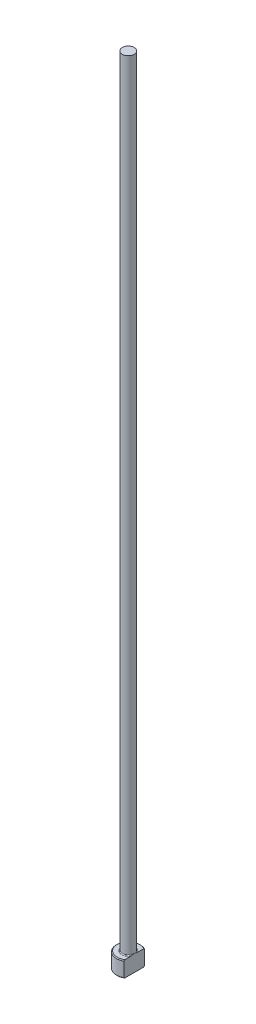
ISO-10303-21;
HEADER;
FILE_DESCRIPTION(('STEP AP214'),'2;1');
FILE_NAME('part.step','',(''),(''),'','','');
FILE_SCHEMA(('AUTOMOTIVE_DESIGN { 1 0 10303 214 1 1 1 1 }'));
ENDSEC;
DATA;
#1=APPLICATION_CONTEXT('core data for automotive mechanical design processes');
#2=APPLICATION_PROTOCOL_DEFINITION('international standard','automotive_design',2000,#1);
#3=PRODUCT_CONTEXT('',#1,'mechanical');
#4=PRODUCT('Part','Part','',(#3));
#5=PRODUCT_RELATED_PRODUCT_CATEGORY('part','',(#4));
#6=PRODUCT_DEFINITION_FORMATION('','',#4);
#7=PRODUCT_DEFINITION_CONTEXT('part definition',#1,'design');
#8=PRODUCT_DEFINITION('design','',#6,#7);
#9=PRODUCT_DEFINITION_SHAPE('','',#8);
#10=(LENGTH_UNIT() NAMED_UNIT(*) SI_UNIT(.MILLI.,.METRE.));
#11=(NAMED_UNIT(*) PLANE_ANGLE_UNIT() SI_UNIT($,.RADIAN.));
#12=(NAMED_UNIT(*) SI_UNIT($,.STERADIAN.) SOLID_ANGLE_UNIT());
#13=UNCERTAINTY_MEASURE_WITH_UNIT(LENGTH_MEASURE(1.E-05),#10,'distance_accuracy_value','');
#14=(GEOMETRIC_REPRESENTATION_CONTEXT(3) GLOBAL_UNCERTAINTY_ASSIGNED_CONTEXT((#13)) GLOBAL_UNIT_ASSIGNED_CONTEXT((#10,
#11,#12)) REPRESENTATION_CONTEXT('',''));
#15=CARTESIAN_POINT('',(0.,0.,0.));
#16=DIRECTION('',(0.,0.,1.));
#17=DIRECTION('',(1.,0.,0.));
#18=AXIS2_PLACEMENT_3D('',#15,#16,#17);
#19=CARTESIAN_POINT('',(0.,0.,0.));
#20=DIRECTION('',(0.,-1.,0.));
#21=DIRECTION('',(0.,0.,-1.));
#22=AXIS2_PLACEMENT_3D('',#19,#20,#21);
#23=PLANE('',#22);
#24=CARTESIAN_POINT('',(0.,0.,0.));
#25=DIRECTION('',(0.,-1.,0.));
#26=DIRECTION('',(0.,0.,-1.));
#27=AXIS2_PLACEMENT_3D('',#24,#25,#26);
#28=CIRCLE('',#27,2.79999999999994);
#29=CARTESIAN_POINT('',(1.49999999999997,0.,2.36431808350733));
#30=VERTEX_POINT('',#29);
#31=CARTESIAN_POINT('',(1.49999999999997,0.,-2.36431808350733));
#32=VERTEX_POINT('',#31);
#33=EDGE_CURVE('E98',#30,#32,#28,.T.);
#34=ORIENTED_EDGE('',*,*,#33,.T.);
#35=DIRECTION('',(0.,0.,1.));
#36=VECTOR('',#35,1.);
#37=CARTESIAN_POINT('',(1.49999999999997,0.,2.5980762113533));
#38=LINE('',#37,#36);
#39=EDGE_CURVE('E83',#32,#30,#38,.T.);
#40=ORIENTED_EDGE('',*,*,#39,.T.);
#41=EDGE_LOOP('',(#34,#40));
#42=FACE_BOUND('',#41,.T.);
#43=ADVANCED_FACE('F32',(#42),#23,.T.);
#44=CARTESIAN_POINT('',(0.,259.958771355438,0.));
#45=DIRECTION('',(0.,1.,0.));
#46=DIRECTION('',(0.,0.,1.));
#47=AXIS2_PLACEMENT_3D('',#44,#45,#46);
#48=CYLINDRICAL_SURFACE('',#47,2.99999999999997);
#49=CARTESIAN_POINT('',(0.,3.79999999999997,0.));
#50=DIRECTION('',(0.,1.,0.));
#51=DIRECTION('',(0.,0.,1.));
#52=AXIS2_PLACEMENT_3D('',#49,#50,#51);
#53=CIRCLE('',#52,2.99999999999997);
#54=CARTESIAN_POINT('',(1.49999999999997,3.79999999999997,2.5980762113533));
#55=VERTEX_POINT('',#54);
#56=CARTESIAN_POINT('',(1.49999999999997,3.79999999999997,-2.5980762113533));
#57=VERTEX_POINT('',#56);
#58=EDGE_CURVE('E104',#55,#57,#53,.F.);
#59=ORIENTED_EDGE('',*,*,#58,.T.);
#60=DIRECTION('',(0.,-1.,0.));
#61=VECTOR('',#60,1.);
#62=CARTESIAN_POINT('',(1.49999999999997,200.,-2.5980762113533));
#63=LINE('',#62,#61);
#64=CARTESIAN_POINT('',(1.49999999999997,0.200000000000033,-2.5980762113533));
#65=VERTEX_POINT('',#64);
#66=EDGE_CURVE('E183',#57,#65,#63,.T.);
#67=ORIENTED_EDGE('',*,*,#66,.T.);
#68=CARTESIAN_POINT('',(0.,0.200000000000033,0.));
#69=DIRECTION('',(0.,-1.,0.));
#70=DIRECTION('',(0.,0.,-1.));
#71=AXIS2_PLACEMENT_3D('',#68,#69,#70);
#72=CIRCLE('',#71,2.99999999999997);
#73=CARTESIAN_POINT('',(1.49999999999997,0.200000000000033,2.5980762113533));
#74=VERTEX_POINT('',#73);
#75=EDGE_CURVE('E100',#65,#74,#72,.F.);
#76=ORIENTED_EDGE('',*,*,#75,.T.);
#77=DIRECTION('',(0.,-1.,0.));
#78=VECTOR('',#77,1.);
#79=CARTESIAN_POINT('',(1.49999999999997,200.,2.5980762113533));
#80=LINE('',#79,#78);
#81=EDGE_CURVE('E93',#55,#74,#80,.T.);
#82=ORIENTED_EDGE('',*,*,#81,.F.);
#83=EDGE_LOOP('',(#59,#67,#76,#82));
#84=FACE_BOUND('',#83,.T.);
#85=ADVANCED_FACE('F158',(#84),#48,.T.);
#86=CARTESIAN_POINT('',(-2.99999999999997,4.,0.));
#87=DIRECTION('',(0.,1.,0.));
#88=DIRECTION('',(0.,0.,1.));
#89=AXIS2_PLACEMENT_3D('',#86,#87,#88);
#90=PLANE('',#89);
#91=CARTESIAN_POINT('',(0.,4.,0.));
#92=DIRECTION('',(0.,1.,0.));
#93=DIRECTION('',(0.,0.,1.));
#94=AXIS2_PLACEMENT_3D('',#91,#92,#93);
#95=CIRCLE('',#94,2.79999999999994);
#96=CARTESIAN_POINT('',(1.49999999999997,4.,-2.36431808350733));
#97=VERTEX_POINT('',#96);
#98=CARTESIAN_POINT('',(1.49999999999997,4.,2.36431808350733));
#99=VERTEX_POINT('',#98);
#100=EDGE_CURVE('E178',#97,#99,#95,.T.);
#101=ORIENTED_EDGE('',*,*,#100,.T.);
#102=DIRECTION('',(0.,0.,-1.));
#103=VECTOR('',#102,1.);
#104=CARTESIAN_POINT('',(1.49999999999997,4.,0.));
#105=LINE('',#104,#103);
#106=CARTESIAN_POINT('',(1.49999999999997,3.99999999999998,0.799999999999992));
#107=VERTEX_POINT('',#106);
#108=EDGE_CURVE('E57',#99,#107,#105,.T.);
#109=ORIENTED_EDGE('',*,*,#108,.T.);
#110=CARTESIAN_POINT('',(0.,4.,0.));
#111=DIRECTION('',(0.,1.,0.));
#112=DIRECTION('',(0.,0.,1.));
#113=AXIS2_PLACEMENT_3D('',#110,#111,#112);
#114=CIRCLE('',#113,1.69999999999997);
#115=CARTESIAN_POINT('',(1.49999999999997,3.99999999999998,-0.799999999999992));
#116=VERTEX_POINT('',#115);
#117=EDGE_CURVE('E107',#107,#116,#114,.F.);
#118=ORIENTED_EDGE('',*,*,#117,.T.);
#119=EDGE_CURVE('E136',#116,#97,#105,.T.);
#120=ORIENTED_EDGE('',*,*,#119,.T.);
#121=EDGE_LOOP('',(#101,#109,#118,#120));
#122=FACE_BOUND('',#121,.T.);
#123=ADVANCED_FACE('F147',(#122),#90,.T.);
#124=CARTESIAN_POINT('',(0.,4.,0.));
#125=DIRECTION('',(0.,-1.,0.));
#126=DIRECTION('',(0.,0.,-1.));
#127=AXIS2_PLACEMENT_3D('',#124,#125,#126);
#128=CONICAL_SURFACE('',#127,2.79999999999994,0.785398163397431);
#129=ORIENTED_EDGE('',*,*,#58,.F.);
#130=CARTESIAN_POINT('',(1.49999999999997,0.888258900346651,5.71827621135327));
#131=CARTESIAN_POINT('',(1.49999999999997,1.01361833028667,5.58866816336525));
#132=CARTESIAN_POINT('',(1.49999999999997,1.13884324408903,5.45892957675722));
#133=CARTESIAN_POINT('',(1.49999999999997,1.38894444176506,5.19911365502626));
#134=CARTESIAN_POINT('',(1.49999999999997,1.51382072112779,5.06903631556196));
#135=CARTESIAN_POINT('',(1.49999999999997,1.76320568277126,4.80840180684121));
#136=CARTESIAN_POINT('',(1.49999999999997,1.88771414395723,4.67784442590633));
#137=CARTESIAN_POINT('',(1.49999999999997,2.13618059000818,4.4162081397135));
#138=CARTESIAN_POINT('',(1.49999999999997,2.26013857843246,4.28512923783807));
#139=CARTESIAN_POINT('',(1.49999999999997,2.50488975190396,4.02490837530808));
#140=CARTESIAN_POINT('',(1.49999999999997,2.62569693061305,3.8957795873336));
#141=CARTESIAN_POINT('',(1.49999999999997,2.86640694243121,3.63668213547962));
#142=CARTESIAN_POINT('',(1.49999999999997,2.98630978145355,3.50671347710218));
#143=CARTESIAN_POINT('',(1.49999999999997,3.22486033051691,3.24567921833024));
#144=CARTESIAN_POINT('',(1.49999999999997,3.3435083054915,3.11461386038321));
#145=CARTESIAN_POINT('',(1.49999999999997,3.5790771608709,2.85094268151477));
#146=CARTESIAN_POINT('',(1.49999999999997,3.69599811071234,2.71833692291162));
#147=CARTESIAN_POINT('',(1.49999999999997,3.88262371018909,2.50255231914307));
#148=CARTESIAN_POINT('',(1.49999999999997,3.95312454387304,2.42006293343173));
#149=CARTESIAN_POINT('',(1.49999999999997,4.09287098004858,2.254010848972));
#150=CARTESIAN_POINT('',(1.49999999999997,4.16211645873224,2.17044804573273));
#151=CARTESIAN_POINT('',(1.49999999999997,4.29964684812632,2.00105967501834));
#152=CARTESIAN_POINT('',(1.49999999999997,4.36791386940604,1.9152195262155));
#153=CARTESIAN_POINT('',(1.49999999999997,4.50205840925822,1.7417139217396));
#154=CARTESIAN_POINT('',(1.49999999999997,4.56793649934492,1.65404891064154));
#155=CARTESIAN_POINT('',(1.49999999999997,4.69728151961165,1.47490236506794));
#156=CARTESIAN_POINT('',(1.49999999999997,4.76069661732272,1.38338308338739));
#157=CARTESIAN_POINT('',(1.49999999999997,4.88239539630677,1.19675661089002));
#158=CARTESIAN_POINT('',(1.49999999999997,4.94067201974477,1.10164473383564));
#159=CARTESIAN_POINT('',(1.49999999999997,5.048413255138,0.908008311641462));
#160=CARTESIAN_POINT('',(1.49999999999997,5.09797809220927,0.809540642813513));
#161=CARTESIAN_POINT('',(1.49999999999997,5.18432188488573,0.607192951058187));
#162=CARTESIAN_POINT('',(1.49999999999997,5.22114374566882,0.503332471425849));
#163=CARTESIAN_POINT('',(1.49999999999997,5.26099935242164,0.347577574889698));
#164=CARTESIAN_POINT('',(1.49999999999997,5.2715702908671,0.297609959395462));
#165=CARTESIAN_POINT('',(1.49999999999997,5.28794860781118,0.196885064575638));
#166=CARTESIAN_POINT('',(1.49999999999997,5.29375640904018,0.146127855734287));
#167=CARTESIAN_POINT('',(1.49999999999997,5.30019707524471,0.0444388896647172));
#168=CARTESIAN_POINT('',(1.49999999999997,5.30084594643,-0.00649183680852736));
#169=CARTESIAN_POINT('',(1.49999999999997,5.29696416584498,-0.108155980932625));
#170=CARTESIAN_POINT('',(1.49999999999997,5.29243308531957,-0.158889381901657));
#171=CARTESIAN_POINT('',(1.49999999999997,5.27856915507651,-0.259234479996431));
#172=CARTESIAN_POINT('',(1.49999999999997,5.2692782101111,-0.308852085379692));
#173=CARTESIAN_POINT('',(1.49999999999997,5.24647108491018,-0.407110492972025));
#174=CARTESIAN_POINT('',(1.49999999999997,5.23295324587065,-0.455750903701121));
#175=CARTESIAN_POINT('',(1.49999999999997,5.20226175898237,-0.55214996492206));
#176=CARTESIAN_POINT('',(1.49999999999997,5.18506801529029,-0.599902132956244));
#177=CARTESIAN_POINT('',(1.49999999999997,5.1477138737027,-0.694205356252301));
#178=CARTESIAN_POINT('',(1.49999999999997,5.12755408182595,-0.740756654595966));
#179=CARTESIAN_POINT('',(1.49999999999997,5.0632769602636,-0.879166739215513));
#180=CARTESIAN_POINT('',(1.49999999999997,5.01551721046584,-0.969329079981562));
#181=CARTESIAN_POINT('',(1.49999999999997,4.91367909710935,-1.14604316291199));
#182=CARTESIAN_POINT('',(1.49999999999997,4.85959300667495,-1.2325903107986));
#183=CARTESIAN_POINT('',(1.49999999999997,4.74697968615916,-1.40321348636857));
#184=CARTESIAN_POINT('',(1.49999999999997,4.68843573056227,-1.4872783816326));
#185=CARTESIAN_POINT('',(1.49999999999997,4.5684384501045,-1.65322187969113));
#186=CARTESIAN_POINT('',(1.49999999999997,4.50698656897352,-1.73510153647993));
#187=CARTESIAN_POINT('',(1.49999999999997,4.3811567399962,-1.89829823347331));
#188=CARTESIAN_POINT('',(1.49999999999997,4.31675092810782,-1.97959369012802));
#189=CARTESIAN_POINT('',(1.49999999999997,4.18634068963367,-2.14090082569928));
#190=CARTESIAN_POINT('',(1.49999999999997,4.12033609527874,-2.2209123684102));
#191=CARTESIAN_POINT('',(1.49999999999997,3.92086431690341,-2.45906508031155));
#192=CARTESIAN_POINT('',(1.49999999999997,3.78562663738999,-2.6157209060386));
#193=CARTESIAN_POINT('',(1.49999999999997,3.53554498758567,-2.90006295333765));
#194=CARTESIAN_POINT('',(1.49999999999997,3.42114543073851,-3.02814382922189));
#195=CARTESIAN_POINT('',(1.49999999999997,3.19093557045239,-3.28303767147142));
#196=CARTESIAN_POINT('',(1.49999999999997,3.07512522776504,-3.40985060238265));
#197=CARTESIAN_POINT('',(1.49999999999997,2.72597067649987,-3.78913849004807));
#198=CARTESIAN_POINT('',(1.49999999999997,2.49111760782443,-4.04022177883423));
#199=CARTESIAN_POINT('',(1.49999999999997,2.0288247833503,-4.52992803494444));
#200=CARTESIAN_POINT('',(1.49999999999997,1.80147747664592,-4.76863870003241));
#201=CARTESIAN_POINT('',(1.49999999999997,1.45954865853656,-5.12558036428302));
#202=CARTESIAN_POINT('',(1.49999999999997,1.34548484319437,-5.24430773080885));
#203=CARTESIAN_POINT('',(1.49999999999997,1.11707176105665,-5.48148573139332));
#204=CARTESIAN_POINT('',(1.49999999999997,1.00272249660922,-5.59993636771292));
#205=CARTESIAN_POINT('',(1.49999999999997,0.888258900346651,-5.71827621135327));
#206=B_SPLINE_CURVE_WITH_KNOTS('',3,(#130,#131,#132,#133,#134,#135,#136,#137,#138,#139,#140,
#141,#142,#143,#144,#145,#146,#147,#148,#149,#150,#151,#152,#153,#154,#155,#156,#157,#158,#159,
#160,#161,#162,#163,#164,#165,#166,#167,#168,#169,#170,#171,#172,#173,#174,#175,#176,#177,#178,
#179,#180,#181,#182,#183,#184,#185,#186,#187,#188,#189,#190,#191,#192,#193,#194,#195,#196,#197,
#198,#199,#200,#201,#202,#203,#204,#205),.UNSPECIFIED.,.F.,.F.,(4,2,2,2,2,2,2,2,2,2,2,2,2,2,2,2,
2,2,2,2,2,2,2,2,2,2,2,2,2,2,2,2,2,2,2,2,2,4),(0.,0.540943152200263,1.08189327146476,
1.62312052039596,2.16434426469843,2.69482920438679,3.22531067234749,3.75567781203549,
4.28602356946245,4.611550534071,4.9371094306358,5.26610945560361,5.59503024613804,
5.92894782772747,6.26331713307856,6.59354403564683,6.92264800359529,7.07567478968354,
7.22868799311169,7.38122626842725,7.53377717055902,7.6850075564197,7.83629736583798,
7.988436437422,8.14054446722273,8.44618799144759,8.75220879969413,9.05944044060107,
9.3665211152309,9.67764287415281,9.98879742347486,10.609592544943,11.1247803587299,
11.6399825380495,12.6713544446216,13.6603005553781,14.1542238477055,14.6481430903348),.UNSPECIFIED.);
#207=EDGE_CURVE('E135',#55,#99,#206,.T.);
#208=ORIENTED_EDGE('',*,*,#207,.T.);
#209=ORIENTED_EDGE('',*,*,#100,.F.);
#210=EDGE_CURVE('E127',#97,#57,#206,.T.);
#211=ORIENTED_EDGE('',*,*,#210,.T.);
#212=EDGE_LOOP('',(#129,#208,#209,#211));
#213=FACE_BOUND('',#212,.T.);
#214=ADVANCED_FACE('F143',(#213),#128,.T.);
#215=CARTESIAN_POINT('',(0.,0.200000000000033,0.));
#216=DIRECTION('',(0.,1.,0.));
#217=DIRECTION('',(0.,0.,1.));
#218=AXIS2_PLACEMENT_3D('',#215,#216,#217);
#219=CONICAL_SURFACE('',#218,2.99999999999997,0.785398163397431);
#220=ORIENTED_EDGE('',*,*,#75,.F.);
#221=CARTESIAN_POINT('',(1.49999999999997,3.11174109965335,-5.71827621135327));
#222=CARTESIAN_POINT('',(1.49999999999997,2.98638166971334,-5.58866816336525));
#223=CARTESIAN_POINT('',(1.49999999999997,2.86115675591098,-5.45892957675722));
#224=CARTESIAN_POINT('',(1.49999999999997,2.61105555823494,-5.19911365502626));
#225=CARTESIAN_POINT('',(1.49999999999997,2.48617927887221,-5.06903631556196));
#226=CARTESIAN_POINT('',(1.49999999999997,2.23679431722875,-4.80840180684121));
#227=CARTESIAN_POINT('',(1.49999999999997,2.11228585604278,-4.67784442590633));
#228=CARTESIAN_POINT('',(1.49999999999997,1.86381940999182,-4.4162081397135));
#229=CARTESIAN_POINT('',(1.49999999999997,1.73986142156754,-4.28512923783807));
#230=CARTESIAN_POINT('',(1.49999999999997,1.49511024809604,-4.02490837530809));
#231=CARTESIAN_POINT('',(1.49999999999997,1.37430306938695,-3.8957795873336));
#232=CARTESIAN_POINT('',(1.49999999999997,1.13359305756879,-3.63668213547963));
#233=CARTESIAN_POINT('',(1.49999999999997,1.01369021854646,-3.50671347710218));
#234=CARTESIAN_POINT('',(1.49999999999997,0.775139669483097,-3.24567921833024));
#235=CARTESIAN_POINT('',(1.49999999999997,0.656491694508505,-3.11461386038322));
#236=CARTESIAN_POINT('',(1.49999999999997,0.420922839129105,-2.85094268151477));
#237=CARTESIAN_POINT('',(1.49999999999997,0.304001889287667,-2.71833692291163));
#238=CARTESIAN_POINT('',(1.49999999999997,0.117376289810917,-2.50255231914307));
#239=CARTESIAN_POINT('',(1.49999999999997,0.0468754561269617,-2.42006293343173));
#240=CARTESIAN_POINT('',(1.49999999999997,-0.0928709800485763,-2.254010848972));
#241=CARTESIAN_POINT('',(1.49999999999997,-0.162116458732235,-2.17044804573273));
#242=CARTESIAN_POINT('',(1.49999999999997,-0.299646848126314,-2.00105967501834));
#243=CARTESIAN_POINT('',(1.49999999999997,-0.367913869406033,-1.9152195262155));
#244=CARTESIAN_POINT('',(1.49999999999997,-0.502058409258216,-1.7417139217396));
#245=CARTESIAN_POINT('',(1.49999999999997,-0.567936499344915,-1.65404891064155));
#246=CARTESIAN_POINT('',(1.49999999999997,-0.69728151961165,-1.47490236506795));
#247=CARTESIAN_POINT('',(1.49999999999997,-0.760696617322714,-1.38338308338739));
#248=CARTESIAN_POINT('',(1.49999999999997,-0.882395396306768,-1.19675661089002));
#249=CARTESIAN_POINT('',(1.49999999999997,-0.940672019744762,-1.10164473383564));
#250=CARTESIAN_POINT('',(1.49999999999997,-1.04841325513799,-0.908008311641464));
#251=CARTESIAN_POINT('',(1.49999999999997,-1.09797809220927,-0.809540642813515));
#252=CARTESIAN_POINT('',(1.49999999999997,-1.18432188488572,-0.607192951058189));
#253=CARTESIAN_POINT('',(1.49999999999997,-1.22114374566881,-0.503332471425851));
#254=CARTESIAN_POINT('',(1.49999999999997,-1.26099935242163,-0.347577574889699));
#255=CARTESIAN_POINT('',(1.49999999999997,-1.2715702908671,-0.297609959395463));
#256=CARTESIAN_POINT('',(1.49999999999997,-1.28794860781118,-0.196885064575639));
#257=CARTESIAN_POINT('',(1.49999999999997,-1.29375640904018,-0.146127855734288));
#258=CARTESIAN_POINT('',(1.49999999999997,-1.30019707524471,-0.0444388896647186));
#259=CARTESIAN_POINT('',(1.49999999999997,-1.30084594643,0.00649183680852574));
#260=CARTESIAN_POINT('',(1.49999999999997,-1.29696416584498,0.108155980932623));
#261=CARTESIAN_POINT('',(1.49999999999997,-1.29243308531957,0.158889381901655));
#262=CARTESIAN_POINT('',(1.49999999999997,-1.2785691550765,0.259234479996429));
#263=CARTESIAN_POINT('',(1.49999999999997,-1.2692782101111,0.30885208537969));
#264=CARTESIAN_POINT('',(1.49999999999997,-1.24647108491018,0.407110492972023));
#265=CARTESIAN_POINT('',(1.49999999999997,-1.23295324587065,0.45575090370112));
#266=CARTESIAN_POINT('',(1.49999999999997,-1.20226175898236,0.552149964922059));
#267=CARTESIAN_POINT('',(1.49999999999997,-1.18506801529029,0.599902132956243));
#268=CARTESIAN_POINT('',(1.49999999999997,-1.14771387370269,0.6942053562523));
#269=CARTESIAN_POINT('',(1.49999999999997,-1.12755408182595,0.740756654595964));
#270=CARTESIAN_POINT('',(1.49999999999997,-1.0632769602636,0.879166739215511));
#271=CARTESIAN_POINT('',(1.49999999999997,-1.01551721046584,0.969329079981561));
#272=CARTESIAN_POINT('',(1.49999999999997,-0.913679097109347,1.14604316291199));
#273=CARTESIAN_POINT('',(1.49999999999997,-0.85959300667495,1.2325903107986));
#274=CARTESIAN_POINT('',(1.49999999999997,-0.746979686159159,1.40321348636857));
#275=CARTESIAN_POINT('',(1.49999999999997,-0.688435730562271,1.4872783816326));
#276=CARTESIAN_POINT('',(1.49999999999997,-0.568438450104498,1.65322187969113));
#277=CARTESIAN_POINT('',(1.49999999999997,-0.506986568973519,1.73510153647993));
#278=CARTESIAN_POINT('',(1.49999999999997,-0.3811567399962,1.89829823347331));
#279=CARTESIAN_POINT('',(1.49999999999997,-0.316750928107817,1.97959369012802));
#280=CARTESIAN_POINT('',(1.49999999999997,-0.186340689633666,2.14090082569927));
#281=CARTESIAN_POINT('',(1.49999999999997,-0.120336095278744,2.22091236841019));
#282=CARTESIAN_POINT('',(1.49999999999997,0.0791356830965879,2.45906508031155));
#283=CARTESIAN_POINT('',(1.49999999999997,0.214373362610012,2.61572090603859));
#284=CARTESIAN_POINT('',(1.49999999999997,0.464455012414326,2.90006295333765));
#285=CARTESIAN_POINT('',(1.49999999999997,0.578854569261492,3.02814382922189));
#286=CARTESIAN_POINT('',(1.49999999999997,0.809064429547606,3.28303767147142));
#287=CARTESIAN_POINT('',(1.49999999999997,0.924874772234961,3.40985060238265));
#288=CARTESIAN_POINT('',(1.49999999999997,1.27402932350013,3.78913849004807));
#289=CARTESIAN_POINT('',(1.49999999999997,1.50888239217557,4.04022177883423));
#290=CARTESIAN_POINT('',(1.49999999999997,1.97117521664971,4.52992803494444));
#291=CARTESIAN_POINT('',(1.49999999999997,2.19852252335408,4.76863870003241));
#292=CARTESIAN_POINT('',(1.49999999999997,2.54045134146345,5.12558036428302));
#293=CARTESIAN_POINT('',(1.49999999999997,2.65451515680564,5.24430773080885));
#294=CARTESIAN_POINT('',(1.49999999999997,2.88292823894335,5.48148573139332));
#295=CARTESIAN_POINT('',(1.49999999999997,2.99727750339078,5.59993636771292));
#296=CARTESIAN_POINT('',(1.49999999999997,3.11174109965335,5.71827621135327));
#297=B_SPLINE_CURVE_WITH_KNOTS('',3,(#221,#222,#223,#224,#225,#226,#227,#228,#229,#230,#231,
#232,#233,#234,#235,#236,#237,#238,#239,#240,#241,#242,#243,#244,#245,#246,#247,#248,#249,#250,
#251,#252,#253,#254,#255,#256,#257,#258,#259,#260,#261,#262,#263,#264,#265,#266,#267,#268,#269,
#270,#271,#272,#273,#274,#275,#276,#277,#278,#279,#280,#281,#282,#283,#284,#285,#286,#287,#288,
#289,#290,#291,#292,#293,#294,#295,#296),.UNSPECIFIED.,.F.,.F.,(4,2,2,2,2,2,2,2,2,2,2,2,2,2,2,2,
2,2,2,2,2,2,2,2,2,2,2,2,2,2,2,2,2,2,2,2,2,4),(0.,0.540943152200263,1.08189327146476,
1.62312052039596,2.16434426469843,2.69482920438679,3.22531067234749,3.75567781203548,
4.28602356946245,4.611550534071,4.9371094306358,5.26610945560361,5.59503024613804,
5.92894782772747,6.26331713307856,6.59354403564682,6.92264800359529,7.07567478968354,
7.22868799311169,7.38122626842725,7.53377717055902,7.68500755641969,7.83629736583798,
7.988436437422,8.14054446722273,8.44618799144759,8.75220879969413,9.05944044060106,
9.3665211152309,9.6776428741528,9.98879742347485,10.609592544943,11.1247803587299,
11.6399825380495,12.6713544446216,13.6603005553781,14.1542238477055,14.6481430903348),.UNSPECIFIED.);
#298=EDGE_CURVE('E86',#65,#32,#297,.T.);
#299=ORIENTED_EDGE('',*,*,#298,.T.);
#300=ORIENTED_EDGE('',*,*,#33,.F.);
#301=EDGE_CURVE('E89',#30,#74,#297,.T.);
#302=ORIENTED_EDGE('',*,*,#301,.T.);
#303=EDGE_LOOP('',(#220,#299,#300,#302));
#304=FACE_BOUND('',#303,.T.);
#305=ADVANCED_FACE('F97',(#304),#219,.T.);
#306=CARTESIAN_POINT('',(0.,4.19999999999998,0.));
#307=DIRECTION('',(0.,1.,0.));
#308=DIRECTION('',(0.,0.,1.));
#309=AXIS2_PLACEMENT_3D('',#306,#307,#308);
#310=TOROIDAL_SURFACE('',#309,1.69999999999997,0.2);
#311=CARTESIAN_POINT('',(1.49999999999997,4.19999999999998,0.));
#312=CARTESIAN_POINT('',(1.49999999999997,4.20000050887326,7.14686072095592E-11));
#313=CARTESIAN_POINT('',(1.49999999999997,4.20000101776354,-1.21663673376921E-07));
#314=CARTESIAN_POINT('',(1.49999999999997,4.20000199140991,-4.97616237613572E-07));
#315=CARTESIAN_POINT('',(1.49999999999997,4.20000245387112,-7.5651622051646E-07));
#316=CARTESIAN_POINT('',(1.49999999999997,4.20000338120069,-1.37642837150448E-06));
#317=CARTESIAN_POINT('',(1.49999999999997,4.20000384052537,-1.74563476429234E-06));
#318=CARTESIAN_POINT('',(1.49999999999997,4.20000469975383,-2.53565984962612E-06));
#319=CARTESIAN_POINT('',(1.49999999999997,4.20000510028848,-2.95582597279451E-06));
#320=CARTESIAN_POINT('',(1.49999999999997,4.20000646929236,-4.48430445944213E-06));
#321=CARTESIAN_POINT('',(1.49999999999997,4.20000736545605,-5.65861039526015E-06));
#322=CARTESIAN_POINT('',(1.49999999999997,4.20000893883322,-8.06479202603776E-06));
#323=CARTESIAN_POINT('',(1.49999999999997,4.20000962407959,-9.29170517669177E-06));
#324=CARTESIAN_POINT('',(1.49999999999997,4.20001225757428,-1.416232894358E-05));
#325=CARTESIAN_POINT('',(1.49999999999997,4.20001407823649,-1.78790031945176E-05));
#326=CARTESIAN_POINT('',(1.49999999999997,4.20001699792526,-2.51443066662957E-05));
#327=CARTESIAN_POINT('',(1.49999999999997,4.20001815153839,-2.86715394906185E-05));
#328=CARTESIAN_POINT('',(1.49999999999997,4.20002315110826,-4.39218128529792E-05));
#329=CARTESIAN_POINT('',(1.49999999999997,4.20002701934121,-5.56288390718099E-05));
#330=CARTESIAN_POINT('',(1.49999999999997,4.20003312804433,-7.7405829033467E-05));
#331=CARTESIAN_POINT('',(1.49999999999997,4.20003553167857,-8.7427841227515E-05));
#332=CARTESIAN_POINT('',(1.49999999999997,4.20005483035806,-0.000161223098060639));
#333=CARTESIAN_POINT('',(1.49999999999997,4.20007979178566,-0.000222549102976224));
#334=CARTESIAN_POINT('',(1.49999999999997,4.20017391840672,-0.000462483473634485));
#335=CARTESIAN_POINT('',(1.49999999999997,4.20023706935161,-0.000642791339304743));
#336=CARTESIAN_POINT('',(1.49999999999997,4.20048761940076,-0.00134785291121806));
#337=CARTESIAN_POINT('',(1.49999999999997,4.20068132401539,-0.00187087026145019));
#338=CARTESIAN_POINT('',(1.49999999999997,4.20147357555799,-0.00402004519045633));
#339=CARTESIAN_POINT('',(1.49999999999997,4.20206499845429,-0.00564811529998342));
#340=CARTESIAN_POINT('',(1.49999999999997,4.20892634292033,-0.0245232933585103));
#341=CARTESIAN_POINT('',(1.49999999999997,4.21523683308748,-0.0417598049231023));
#342=CARTESIAN_POINT('',(1.49999999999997,4.22755028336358,-0.0756091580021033));
#343=CARTESIAN_POINT('',(1.49999999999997,4.23355589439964,-0.0922211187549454));
#344=CARTESIAN_POINT('',(1.49999999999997,4.24620101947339,-0.12745424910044));
#345=CARTESIAN_POINT('',(1.49999999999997,4.25283080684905,-0.146078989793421));
#346=CARTESIAN_POINT('',(1.49999999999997,4.26599765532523,-0.183577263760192));
#347=CARTESIAN_POINT('',(1.49999999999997,4.27253305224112,-0.202451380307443));
#348=CARTESIAN_POINT('',(1.49999999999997,4.28834228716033,-0.248982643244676));
#349=CARTESIAN_POINT('',(1.49999999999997,4.2974915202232,-0.276682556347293));
#350=CARTESIAN_POINT('',(1.49999999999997,4.31490935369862,-0.331625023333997));
#351=CARTESIAN_POINT('',(1.49999999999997,4.32319386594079,-0.35886250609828));
#352=CARTESIAN_POINT('',(1.49999999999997,4.34051594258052,-0.419125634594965));
#353=CARTESIAN_POINT('',(1.49999999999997,4.34936607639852,-0.452206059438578));
#354=CARTESIAN_POINT('',(1.49999999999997,4.36549583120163,-0.519023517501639));
#355=CARTESIAN_POINT('',(1.49999999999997,4.37276283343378,-0.55276364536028));
#356=CARTESIAN_POINT('',(1.49999999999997,4.38554755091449,-0.623053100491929));
#357=CARTESIAN_POINT('',(1.49999999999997,4.39090573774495,-0.659632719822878));
#358=CARTESIAN_POINT('',(1.49999999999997,4.39825016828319,-0.733028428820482));
#359=CARTESIAN_POINT('',(1.49999999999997,4.40024734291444,-0.769843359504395));
#360=CARTESIAN_POINT('',(1.49999999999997,4.39970780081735,-0.842856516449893));
#361=CARTESIAN_POINT('',(1.49999999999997,4.39725347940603,-0.87905368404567));
#362=CARTESIAN_POINT('',(1.49999999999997,4.38900085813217,-0.932380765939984));
#363=CARTESIAN_POINT('',(1.49999999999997,4.38553049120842,-0.949868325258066));
#364=CARTESIAN_POINT('',(1.49999999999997,4.37678336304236,-0.984374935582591));
#365=CARTESIAN_POINT('',(1.49999999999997,4.37150943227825,-1.00139467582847));
#366=CARTESIAN_POINT('',(1.49999999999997,4.35869781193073,-1.03479423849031));
#367=CARTESIAN_POINT('',(1.49999999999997,4.3511359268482,-1.05116499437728));
#368=CARTESIAN_POINT('',(1.49999999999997,4.33325333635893,-1.08234828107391));
#369=CARTESIAN_POINT('',(1.49999999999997,4.32294266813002,-1.097166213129));
#370=CARTESIAN_POINT('',(1.49999999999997,4.30512758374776,-1.11714173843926));
#371=CARTESIAN_POINT('',(1.49999999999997,4.29884721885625,-1.1233906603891));
#372=CARTESIAN_POINT('',(1.49999999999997,4.28545950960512,-1.13494695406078));
#373=CARTESIAN_POINT('',(1.49999999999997,4.27835226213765,-1.14025443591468));
#374=CARTESIAN_POINT('',(1.49999999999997,4.26325970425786,-1.14967631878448));
#375=CARTESIAN_POINT('',(1.49999999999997,4.25526534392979,-1.1537764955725));
#376=CARTESIAN_POINT('',(1.49999999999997,4.23863207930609,-1.16034952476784));
#377=CARTESIAN_POINT('',(1.49999999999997,4.22999427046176,-1.16282507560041));
#378=CARTESIAN_POINT('',(1.49999999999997,4.21343922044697,-1.16570267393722));
#379=CARTESIAN_POINT('',(1.49999999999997,4.20555896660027,-1.16631687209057));
#380=CARTESIAN_POINT('',(1.49999999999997,4.18982775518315,-1.16602054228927));
#381=CARTESIAN_POINT('',(1.49999999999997,4.18197679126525,-1.16511036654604));
#382=CARTESIAN_POINT('',(1.49999999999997,4.16747846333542,-1.16204446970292));
#383=CARTESIAN_POINT('',(1.49999999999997,4.16079696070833,-1.16004509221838));
#384=CARTESIAN_POINT('',(1.49999999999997,4.14781700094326,-1.15505972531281));
#385=CARTESIAN_POINT('',(1.49999999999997,4.14151862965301,-1.1520735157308));
#386=CARTESIAN_POINT('',(1.49999999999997,4.12690214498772,-1.14387585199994));
#387=CARTESIAN_POINT('',(1.49999999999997,4.11881436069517,-1.13825400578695));
#388=CARTESIAN_POINT('',(1.49999999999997,4.10364440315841,-1.12578441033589));
#389=CARTESIAN_POINT('',(1.49999999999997,4.09656475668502,-1.11893367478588));
#390=CARTESIAN_POINT('',(1.49999999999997,4.08012297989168,-1.10074342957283));
#391=CARTESIAN_POINT('',(1.49999999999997,4.07136543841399,-1.08886044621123));
#392=CARTESIAN_POINT('',(1.49999999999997,4.05578194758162,-1.06392743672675));
#393=CARTESIAN_POINT('',(1.49999999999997,4.0489571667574,-1.05087671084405));
#394=CARTESIAN_POINT('',(1.49999999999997,4.03273856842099,-1.0147230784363));
#395=CARTESIAN_POINT('',(1.49999999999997,4.02486230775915,-0.990945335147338));
#396=CARTESIAN_POINT('',(1.49999999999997,4.01257693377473,-0.942321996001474));
#397=CARTESIAN_POINT('',(1.49999999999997,4.00820590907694,-0.917467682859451));
#398=CARTESIAN_POINT('',(1.49999999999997,4.00229956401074,-0.867912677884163));
#399=CARTESIAN_POINT('',(1.49999999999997,4.0007128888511,-0.843217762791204));
#400=CARTESIAN_POINT('',(1.49999999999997,3.9996723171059,-0.793746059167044));
#401=CARTESIAN_POINT('',(1.49999999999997,4.0002230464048,-0.768969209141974));
#402=CARTESIAN_POINT('',(1.49999999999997,4.00433101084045,-0.696994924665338));
#403=CARTESIAN_POINT('',(1.49999999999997,4.01016976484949,-0.649931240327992));
#404=CARTESIAN_POINT('',(1.49999999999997,4.02567776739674,-0.559166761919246));
#405=CARTESIAN_POINT('',(1.49999999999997,4.03511950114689,-0.515423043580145));
#406=CARTESIAN_POINT('',(1.49999999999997,4.05693059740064,-0.427590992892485));
#407=CARTESIAN_POINT('',(1.49999999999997,4.06936356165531,-0.383518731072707));
#408=CARTESIAN_POINT('',(1.49999999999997,4.09174953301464,-0.310161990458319));
#409=CARTESIAN_POINT('',(1.49999999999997,4.10119843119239,-0.280718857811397));
#410=CARTESIAN_POINT('',(1.49999999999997,4.12060442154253,-0.222340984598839));
#411=CARTESIAN_POINT('',(1.49999999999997,4.13055519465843,-0.193404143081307));
#412=CARTESIAN_POINT('',(1.49999999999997,4.14973721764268,-0.138756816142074));
#413=CARTESIAN_POINT('',(1.49999999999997,4.15893123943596,-0.113033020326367));
#414=CARTESIAN_POINT('',(1.49999999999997,4.1778803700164,-0.0606351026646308));
#415=CARTESIAN_POINT('',(1.49999999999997,4.18764328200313,-0.0339636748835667));
#416=CARTESIAN_POINT('',(1.49999999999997,4.19793548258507,-0.00564657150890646));
#417=CARTESIAN_POINT('',(1.49999999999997,4.19852751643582,-0.00401699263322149));
#418=CARTESIAN_POINT('',(1.49999999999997,4.19931992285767,-0.00186745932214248));
#419=CARTESIAN_POINT('',(1.49999999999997,4.1995131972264,-0.00134559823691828));
#420=CARTESIAN_POINT('',(1.49999999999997,4.19976322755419,-0.000641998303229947));
#421=CARTESIAN_POINT('',(1.49999999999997,4.19982627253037,-0.000461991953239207));
#422=CARTESIAN_POINT('',(1.49999999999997,4.19992025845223,-0.000222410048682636));
#423=CARTESIAN_POINT('',(1.49999999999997,4.19994519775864,-0.000161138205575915));
#424=CARTESIAN_POINT('',(1.49999999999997,4.19996448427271,-8.74039267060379E-05));
#425=CARTESIAN_POINT('',(1.49999999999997,4.19996688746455,-7.73857556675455E-05));
#426=CARTESIAN_POINT('',(1.49999999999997,4.19997299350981,-5.56173272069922E-05));
#427=CARTESIAN_POINT('',(1.49999999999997,4.19997685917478,-4.39149186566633E-05));
#428=CARTESIAN_POINT('',(1.49999999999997,4.19998185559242,-2.86698156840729E-05));
#429=CARTESIAN_POINT('',(1.49999999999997,4.19998300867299,-2.51431575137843E-05));
#430=CARTESIAN_POINT('',(1.49999999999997,4.19998592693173,-1.78789552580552E-05));
#431=CARTESIAN_POINT('',(1.49999999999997,4.19998774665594,-1.41627846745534E-05));
#432=CARTESIAN_POINT('',(1.49999999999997,4.19999037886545,-9.29264488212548E-06));
#433=CARTESIAN_POINT('',(1.49999999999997,4.19999106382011,-8.06577599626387E-06));
#434=CARTESIAN_POINT('',(1.49999999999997,4.19999263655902,-5.65962639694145E-06));
#435=CARTESIAN_POINT('',(1.49999999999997,4.19999353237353,-4.48530466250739E-06));
#436=CARTESIAN_POINT('',(1.49999999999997,4.19999490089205,-2.95673740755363E-06));
#437=CARTESIAN_POINT('',(1.49999999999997,4.1999953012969,-2.53653208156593E-06));
#438=CARTESIAN_POINT('',(1.49999999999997,4.19999616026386,-1.74640525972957E-06));
#439=CARTESIAN_POINT('',(1.49999999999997,4.19999661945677,-1.37713598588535E-06));
#440=CARTESIAN_POINT('',(1.49999999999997,4.19999754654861,-7.57072336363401E-07));
#441=CARTESIAN_POINT('',(1.49999999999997,4.19999800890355,-4.98087387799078E-07));
#442=CARTESIAN_POINT('',(1.49999999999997,4.19999898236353,-1.21927250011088E-07));
#443=CARTESIAN_POINT('',(1.49999999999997,4.19999949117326,-7.14620692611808E-11));
#444=CARTESIAN_POINT('',(1.49999999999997,4.19999999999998,0.));
#445=B_SPLINE_CURVE_WITH_KNOTS('',3,(#311,#312,#313,#314,#315,#316,#317,#318,#319,#320,#321,
#322,#323,#324,#325,#326,#327,#328,#329,#330,#331,#332,#333,#334,#335,#336,#337,#338,#339,#340,
#341,#342,#343,#344,#345,#346,#347,#348,#349,#350,#351,#352,#353,#354,#355,#356,#357,#358,#359,
#360,#361,#362,#363,#364,#365,#366,#367,#368,#369,#370,#371,#372,#373,#374,#375,#376,#377,#378,
#379,#380,#381,#382,#383,#384,#385,#386,#387,#388,#389,#390,#391,#392,#393,#394,#395,#396,#397,
#398,#399,#400,#401,#402,#403,#404,#405,#406,#407,#408,#409,#410,#411,#412,#413,#414,#415,#416,
#417,#418,#419,#420,#421,#422,#423,#424,#425,#426,#427,#428,#429,#430,#431,#432,#433,#434,#435,
#436,#437,#438,#439,#440,#441,#442,#443,#444),.UNSPECIFIED.,.T.,.F.,(4,2,2,2,2,2,2,2,2,2,2,2,2,
2,2,2,2,2,2,2,2,2,2,2,2,2,2,2,2,2,2,2,2,2,2,2,2,2,2,2,2,2,2,2,2,2,2,2,2,2,2,2,2,2,2,2,2,2,2,2,2,
2,2,2,2,2,4),(0.,1.5268750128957E-06,3.10959387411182E-06,4.86976756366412E-06,
6.60940084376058E-06,1.10202525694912E-05,1.5232779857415E-05,2.76140371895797E-05,
3.87351645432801E-05,7.5718833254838E-05,0.000106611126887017,0.000304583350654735,
0.000878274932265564,0.00255078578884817,0.00774802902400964,0.0628090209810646,
0.115802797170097,0.175110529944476,0.235030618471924,0.322539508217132,0.407938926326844,
0.510638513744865,0.614128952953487,0.724918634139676,0.835347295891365,0.943752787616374,
0.997165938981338,1.05049564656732,1.10441029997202,1.1581307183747,1.18463966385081,
1.21114550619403,1.23795217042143,1.26471419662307,1.28828324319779,1.31184684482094,
1.33268332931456,1.35352446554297,1.38290826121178,1.41236445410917,1.45639976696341,
1.5004616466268,1.5751878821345,1.65071550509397,1.72483484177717,1.79911468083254,
1.94105061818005,2.07520625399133,2.21251544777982,2.30527614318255,2.39707056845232,
2.47902409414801,2.56422207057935,2.56942417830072,2.5710929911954,2.57166572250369,
2.57186352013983,2.5718944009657,2.57193136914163,2.57194248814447,2.57195486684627,
2.57195907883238,2.57196348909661,2.57196522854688,2.57196698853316,2.57196857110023,
2.57197009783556),.UNSPECIFIED.);
#446=CARTESIAN_POINT('',(1.49999999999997,4.19999999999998,0.));
#447=VERTEX_POINT('',#446);
#448=EDGE_CURVE('E11',#116,#447,#445,.T.);
#449=ORIENTED_EDGE('',*,*,#448,.F.);
#450=ORIENTED_EDGE('',*,*,#117,.F.);
#451=CARTESIAN_POINT('',(1.49999999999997,4.19999999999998,0.));
#452=CARTESIAN_POINT('',(1.49999999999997,4.1999994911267,-7.14686002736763E-11));
#453=CARTESIAN_POINT('',(1.49999999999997,4.19999898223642,1.21663673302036E-07));
#454=CARTESIAN_POINT('',(1.49999999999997,4.19999800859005,4.97616237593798E-07));
#455=CARTESIAN_POINT('',(1.49999999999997,4.19999754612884,7.56516220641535E-07));
#456=CARTESIAN_POINT('',(1.49999999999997,4.19999661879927,1.37642837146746E-06));
#457=CARTESIAN_POINT('',(1.49999999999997,4.1999961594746,1.74563476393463E-06));
#458=CARTESIAN_POINT('',(1.49999999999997,4.19999530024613,2.5356598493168E-06));
#459=CARTESIAN_POINT('',(1.49999999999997,4.19999489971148,2.95582597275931E-06));
#460=CARTESIAN_POINT('',(1.49999999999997,4.1999935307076,4.48430446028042E-06));
#461=CARTESIAN_POINT('',(1.49999999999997,4.19999263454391,5.65861039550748E-06));
#462=CARTESIAN_POINT('',(1.49999999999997,4.19999106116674,8.06479202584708E-06));
#463=CARTESIAN_POINT('',(1.49999999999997,4.19999037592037,9.29170517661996E-06));
#464=CARTESIAN_POINT('',(1.49999999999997,4.19998774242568,1.41623289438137E-05));
#465=CARTESIAN_POINT('',(1.49999999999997,4.19998592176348,1.78790031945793E-05));
#466=CARTESIAN_POINT('',(1.49999999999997,4.1999830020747,2.51443066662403E-05));
#467=CARTESIAN_POINT('',(1.49999999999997,4.19998184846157,2.86715394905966E-05));
#468=CARTESIAN_POINT('',(1.49999999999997,4.1999768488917,4.39218128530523E-05));
#469=CARTESIAN_POINT('',(1.49999999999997,4.19997298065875,5.56288390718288E-05));
#470=CARTESIAN_POINT('',(1.49999999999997,4.19996687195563,7.74058290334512E-05));
#471=CARTESIAN_POINT('',(1.49999999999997,4.1999644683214,8.7427841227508E-05));
#472=CARTESIAN_POINT('',(1.49999999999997,4.1999451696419,0.000161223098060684));
#473=CARTESIAN_POINT('',(1.49999999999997,4.1999202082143,0.000222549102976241));
#474=CARTESIAN_POINT('',(1.49999999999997,4.19982608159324,0.000462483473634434));
#475=CARTESIAN_POINT('',(1.49999999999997,4.19976293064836,0.000642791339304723));
#476=CARTESIAN_POINT('',(1.49999999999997,4.1995123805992,0.00134785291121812));
#477=CARTESIAN_POINT('',(1.49999999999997,4.19931867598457,0.00187087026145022));
#478=CARTESIAN_POINT('',(1.49999999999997,4.19852642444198,0.00402004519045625));
#479=CARTESIAN_POINT('',(1.49999999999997,4.19793500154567,0.00564811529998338));
#480=CARTESIAN_POINT('',(1.49999999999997,4.19107365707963,0.0245232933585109));
#481=CARTESIAN_POINT('',(1.49999999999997,4.18476316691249,0.0417598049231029));
#482=CARTESIAN_POINT('',(1.49999999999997,4.17244971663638,0.0756091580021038));
#483=CARTESIAN_POINT('',(1.49999999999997,4.16644410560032,0.0922211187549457));
#484=CARTESIAN_POINT('',(1.49999999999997,4.15379898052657,0.12745424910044));
#485=CARTESIAN_POINT('',(1.49999999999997,4.14716919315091,0.146078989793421));
#486=CARTESIAN_POINT('',(1.49999999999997,4.13400234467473,0.183577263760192));
#487=CARTESIAN_POINT('',(1.49999999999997,4.12746694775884,0.202451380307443));
#488=CARTESIAN_POINT('',(1.49999999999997,4.11165771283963,0.248982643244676));
#489=CARTESIAN_POINT('',(1.49999999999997,4.10250847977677,0.276682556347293));
#490=CARTESIAN_POINT('',(1.49999999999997,4.08509064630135,0.331625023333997));
#491=CARTESIAN_POINT('',(1.49999999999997,4.07680613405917,0.35886250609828));
#492=CARTESIAN_POINT('',(1.49999999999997,4.05948405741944,0.419125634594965));
#493=CARTESIAN_POINT('',(1.49999999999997,4.05063392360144,0.452206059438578));
#494=CARTESIAN_POINT('',(1.49999999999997,4.03450416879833,0.51902351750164));
#495=CARTESIAN_POINT('',(1.49999999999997,4.02723716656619,0.55276364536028));
#496=CARTESIAN_POINT('',(1.49999999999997,4.01445244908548,0.623053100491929));
#497=CARTESIAN_POINT('',(1.49999999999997,4.00909426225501,0.659632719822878));
#498=CARTESIAN_POINT('',(1.49999999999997,4.00174983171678,0.733028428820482));
#499=CARTESIAN_POINT('',(1.49999999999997,3.99975265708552,0.769843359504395));
#500=CARTESIAN_POINT('',(1.49999999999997,4.00029219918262,0.842856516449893));
#501=CARTESIAN_POINT('',(1.49999999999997,4.00274652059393,0.87905368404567));
#502=CARTESIAN_POINT('',(1.49999999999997,4.0109991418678,0.932380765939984));
#503=CARTESIAN_POINT('',(1.49999999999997,4.01446950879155,0.949868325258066));
#504=CARTESIAN_POINT('',(1.49999999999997,4.02321663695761,0.984374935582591));
#505=CARTESIAN_POINT('',(1.49999999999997,4.02849056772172,1.00139467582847));
#506=CARTESIAN_POINT('',(1.49999999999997,4.04130218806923,1.03479423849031));
#507=CARTESIAN_POINT('',(1.49999999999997,4.04886407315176,1.05116499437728));
#508=CARTESIAN_POINT('',(1.49999999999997,4.06674666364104,1.08234828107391));
#509=CARTESIAN_POINT('',(1.49999999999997,4.07705733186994,1.097166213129));
#510=CARTESIAN_POINT('',(1.49999999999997,4.09487241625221,1.11714173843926));
#511=CARTESIAN_POINT('',(1.49999999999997,4.10115278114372,1.1233906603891));
#512=CARTESIAN_POINT('',(1.49999999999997,4.11454049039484,1.13494695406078));
#513=CARTESIAN_POINT('',(1.49999999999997,4.12164773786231,1.14025443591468));
#514=CARTESIAN_POINT('',(1.49999999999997,4.13674029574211,1.14967631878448));
#515=CARTESIAN_POINT('',(1.49999999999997,4.14473465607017,1.1537764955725));
#516=CARTESIAN_POINT('',(1.49999999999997,4.16136792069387,1.16034952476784));
#517=CARTESIAN_POINT('',(1.49999999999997,4.1700057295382,1.16282507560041));
#518=CARTESIAN_POINT('',(1.49999999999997,4.18656077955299,1.16570267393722));
#519=CARTESIAN_POINT('',(1.49999999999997,4.19444103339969,1.16631687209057));
#520=CARTESIAN_POINT('',(1.49999999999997,4.21017224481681,1.16602054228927));
#521=CARTESIAN_POINT('',(1.49999999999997,4.21802320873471,1.16511036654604));
#522=CARTESIAN_POINT('',(1.49999999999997,4.23252153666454,1.16204446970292));
#523=CARTESIAN_POINT('',(1.49999999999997,4.23920303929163,1.16004509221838));
#524=CARTESIAN_POINT('',(1.49999999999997,4.2521829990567,1.15505972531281));
#525=CARTESIAN_POINT('',(1.49999999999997,4.25848137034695,1.1520735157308));
#526=CARTESIAN_POINT('',(1.49999999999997,4.27309785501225,1.14387585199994));
#527=CARTESIAN_POINT('',(1.49999999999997,4.28118563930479,1.13825400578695));
#528=CARTESIAN_POINT('',(1.49999999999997,4.29635559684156,1.12578441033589));
#529=CARTESIAN_POINT('',(1.49999999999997,4.30343524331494,1.11893367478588));
#530=CARTESIAN_POINT('',(1.49999999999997,4.31987702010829,1.10074342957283));
#531=CARTESIAN_POINT('',(1.49999999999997,4.32863456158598,1.08886044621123));
#532=CARTESIAN_POINT('',(1.49999999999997,4.34421805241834,1.06392743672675));
#533=CARTESIAN_POINT('',(1.49999999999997,4.35104283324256,1.05087671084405));
#534=CARTESIAN_POINT('',(1.49999999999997,4.36726143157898,1.0147230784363));
#535=CARTESIAN_POINT('',(1.49999999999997,4.37513769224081,0.990945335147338));
#536=CARTESIAN_POINT('',(1.49999999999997,4.38742306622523,0.942321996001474));
#537=CARTESIAN_POINT('',(1.49999999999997,4.39179409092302,0.917467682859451));
#538=CARTESIAN_POINT('',(1.49999999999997,4.39770043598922,0.867912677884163));
#539=CARTESIAN_POINT('',(1.49999999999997,4.39928711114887,0.843217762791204));
#540=CARTESIAN_POINT('',(1.49999999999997,4.40032768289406,0.793746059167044));
#541=CARTESIAN_POINT('',(1.49999999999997,4.39977695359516,0.768969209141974));
#542=CARTESIAN_POINT('',(1.49999999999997,4.39566898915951,0.696994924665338));
#543=CARTESIAN_POINT('',(1.49999999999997,4.38983023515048,0.649931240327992));
#544=CARTESIAN_POINT('',(1.49999999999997,4.37432223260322,0.559166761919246));
#545=CARTESIAN_POINT('',(1.49999999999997,4.36488049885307,0.515423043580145));
#546=CARTESIAN_POINT('',(1.49999999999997,4.34306940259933,0.427590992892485));
#547=CARTESIAN_POINT('',(1.49999999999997,4.33063643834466,0.383518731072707));
#548=CARTESIAN_POINT('',(1.49999999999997,4.30825046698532,0.310161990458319));
#549=CARTESIAN_POINT('',(1.49999999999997,4.29880156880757,0.280718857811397));
#550=CARTESIAN_POINT('',(1.49999999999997,4.27939557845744,0.222340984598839));
#551=CARTESIAN_POINT('',(1.49999999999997,4.26944480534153,0.193404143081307));
#552=CARTESIAN_POINT('',(1.49999999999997,4.25026278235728,0.138756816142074));
#553=CARTESIAN_POINT('',(1.49999999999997,4.241068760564,0.113033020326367));
#554=CARTESIAN_POINT('',(1.49999999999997,4.22211962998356,0.0606351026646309));
#555=CARTESIAN_POINT('',(1.49999999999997,4.21235671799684,0.0339636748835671));
#556=CARTESIAN_POINT('',(1.49999999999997,4.20206451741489,0.00564657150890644));
#557=CARTESIAN_POINT('',(1.49999999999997,4.20147248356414,0.00401699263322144));
#558=CARTESIAN_POINT('',(1.49999999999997,4.20068007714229,0.00186745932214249));
#559=CARTESIAN_POINT('',(1.49999999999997,4.20048680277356,0.00134559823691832));
#560=CARTESIAN_POINT('',(1.49999999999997,4.20023677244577,0.000641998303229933));
#561=CARTESIAN_POINT('',(1.49999999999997,4.2001737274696,0.000461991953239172));
#562=CARTESIAN_POINT('',(1.49999999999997,4.20007974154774,0.000222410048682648));
#563=CARTESIAN_POINT('',(1.49999999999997,4.20005480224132,0.000161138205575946));
#564=CARTESIAN_POINT('',(1.49999999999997,4.20003551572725,8.7403926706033E-05));
#565=CARTESIAN_POINT('',(1.49999999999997,4.20003311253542,7.73857556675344E-05));
#566=CARTESIAN_POINT('',(1.49999999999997,4.20002700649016,5.56173272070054E-05));
#567=CARTESIAN_POINT('',(1.49999999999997,4.20002314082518,4.39149186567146E-05));
#568=CARTESIAN_POINT('',(1.49999999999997,4.20001814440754,2.86698156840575E-05));
#569=CARTESIAN_POINT('',(1.49999999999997,4.20001699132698,2.51431575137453E-05));
#570=CARTESIAN_POINT('',(1.49999999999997,4.20001407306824,1.78789552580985E-05));
#571=CARTESIAN_POINT('',(1.49999999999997,4.20001225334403,1.41627846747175E-05));
#572=CARTESIAN_POINT('',(1.49999999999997,4.20000962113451,9.29264488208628E-06));
#573=CARTESIAN_POINT('',(1.49999999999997,4.20000893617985,8.06577599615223E-06));
#574=CARTESIAN_POINT('',(1.49999999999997,4.20000736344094,5.65962639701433E-06));
#575=CARTESIAN_POINT('',(1.49999999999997,4.20000646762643,4.48530466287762E-06));
#576=CARTESIAN_POINT('',(1.49999999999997,4.20000509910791,2.95673740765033E-06));
#577=CARTESIAN_POINT('',(1.49999999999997,4.20000469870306,2.53653208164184E-06));
#578=CARTESIAN_POINT('',(1.49999999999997,4.2000038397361,1.7464052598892E-06));
#579=CARTESIAN_POINT('',(1.49999999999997,4.20000338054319,1.37713598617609E-06));
#580=CARTESIAN_POINT('',(1.49999999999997,4.20000245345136,7.57072336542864E-07));
#581=CARTESIAN_POINT('',(1.49999999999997,4.20000199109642,4.98087387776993E-07));
#582=CARTESIAN_POINT('',(1.49999999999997,4.20000101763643,1.2192724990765E-07));
#583=CARTESIAN_POINT('',(1.49999999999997,4.20000050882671,7.14620623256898E-11));
#584=CARTESIAN_POINT('',(1.49999999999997,4.19999999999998,0.));
#585=B_SPLINE_CURVE_WITH_KNOTS('',3,(#451,#452,#453,#454,#455,#456,#457,#458,#459,#460,#461,
#462,#463,#464,#465,#466,#467,#468,#469,#470,#471,#472,#473,#474,#475,#476,#477,#478,#479,#480,
#481,#482,#483,#484,#485,#486,#487,#488,#489,#490,#491,#492,#493,#494,#495,#496,#497,#498,#499,
#500,#501,#502,#503,#504,#505,#506,#507,#508,#509,#510,#511,#512,#513,#514,#515,#516,#517,#518,
#519,#520,#521,#522,#523,#524,#525,#526,#527,#528,#529,#530,#531,#532,#533,#534,#535,#536,#537,
#538,#539,#540,#541,#542,#543,#544,#545,#546,#547,#548,#549,#550,#551,#552,#553,#554,#555,#556,
#557,#558,#559,#560,#561,#562,#563,#564,#565,#566,#567,#568,#569,#570,#571,#572,#573,#574,#575,
#576,#577,#578,#579,#580,#581,#582,#583,#584),.UNSPECIFIED.,.T.,.F.,(4,2,2,2,2,2,2,2,2,2,2,2,2,
2,2,2,2,2,2,2,2,2,2,2,2,2,2,2,2,2,2,2,2,2,2,2,2,2,2,2,2,2,2,2,2,2,2,2,2,2,2,2,2,2,2,2,2,2,2,2,2,
2,2,2,2,2,4),(0.,1.52687501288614E-06,3.10959387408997E-06,4.86976756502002E-06,
6.60940084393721E-06,1.10202525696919E-05,1.52327798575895E-05,2.76140371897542E-05,
3.87351645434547E-05,7.57188332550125E-05,0.000106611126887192,0.000304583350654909,
0.000878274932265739,0.00255078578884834,0.00774802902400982,0.0628090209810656,
0.115802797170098,0.175110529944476,0.235030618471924,0.322539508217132,0.407938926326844,
0.510638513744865,0.614128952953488,0.724918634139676,0.835347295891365,0.943752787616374,
0.997165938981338,1.05049564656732,1.10441029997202,1.1581307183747,1.18463966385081,
1.21114550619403,1.23795217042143,1.26471419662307,1.28828324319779,1.31184684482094,
1.33268332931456,1.35352446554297,1.38290826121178,1.41236445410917,1.45639976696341,
1.5004616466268,1.5751878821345,1.65071550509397,1.72483484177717,1.79911468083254,
1.94105061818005,2.07520625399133,2.21251544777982,2.30527614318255,2.39707056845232,
2.47902409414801,2.56422207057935,2.56942417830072,2.5710929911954,2.57166572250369,
2.57186352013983,2.5718944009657,2.57193136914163,2.57194248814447,2.57195486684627,
2.57195907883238,2.57196348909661,2.57196522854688,2.57196698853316,2.57196857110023,
2.57197009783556),.UNSPECIFIED.);
#586=EDGE_CURVE('E46',#447,#107,#585,.T.);
#587=ORIENTED_EDGE('',*,*,#586,.F.);
#588=CARTESIAN_POINT('',(0.,4.19999999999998,0.));
#589=DIRECTION('',(0.,1.,0.));
#590=DIRECTION('',(0.,0.,1.));
#591=AXIS2_PLACEMENT_3D('',#588,#589,#590);
#592=CIRCLE('',#591,1.49999999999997);
#593=EDGE_CURVE('E103',#447,#447,#592,.T.);
#594=ORIENTED_EDGE('',*,*,#593,.F.);
#595=EDGE_LOOP('',(#449,#450,#587,#594));
#596=FACE_BOUND('',#595,.T.);
#597=ADVANCED_FACE('F34',(#596),#310,.F.);
#598=CARTESIAN_POINT('',(0.,259.958771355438,0.));
#599=DIRECTION('',(0.,1.,0.));
#600=DIRECTION('',(0.,0.,1.));
#601=AXIS2_PLACEMENT_3D('',#598,#599,#600);
#602=CYLINDRICAL_SURFACE('',#601,1.49999999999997);
#603=ORIENTED_EDGE('',*,*,#593,.T.);
#604=EDGE_LOOP('',(#603));
#605=FACE_BOUND('',#604,.T.);
#606=CARTESIAN_POINT('',(0.,200.,0.));
#607=DIRECTION('',(0.,1.,0.));
#608=DIRECTION('',(0.,0.,1.));
#609=AXIS2_PLACEMENT_3D('',#606,#607,#608);
#610=CIRCLE('',#609,1.49999999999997);
#611=CARTESIAN_POINT('',(0.,200.,1.49999999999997));
#612=VERTEX_POINT('',#611);
#613=EDGE_CURVE('E101',#612,#612,#610,.T.);
#614=ORIENTED_EDGE('',*,*,#613,.F.);
#615=EDGE_LOOP('',(#614));
#616=FACE_BOUND('',#615,.T.);
#617=ADVANCED_FACE('F155',(#605,#616),#602,.T.);
#618=CARTESIAN_POINT('',(-1.49999999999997,200.,0.));
#619=DIRECTION('',(0.,1.,0.));
#620=DIRECTION('',(0.,0.,1.));
#621=AXIS2_PLACEMENT_3D('',#618,#619,#620);
#622=PLANE('',#621);
#623=ORIENTED_EDGE('',*,*,#613,.T.);
#624=EDGE_LOOP('',(#623));
#625=FACE_BOUND('',#624,.T.);
#626=ADVANCED_FACE('F121',(#625),#622,.T.);
#627=CARTESIAN_POINT('',(1.49999999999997,200.,2.5980762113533));
#628=DIRECTION('',(1.,0.,0.));
#629=DIRECTION('',(0.,0.,-1.));
#630=AXIS2_PLACEMENT_3D('',#627,#628,#629);
#631=PLANE('',#630);
#632=ORIENTED_EDGE('',*,*,#66,.F.);
#633=ORIENTED_EDGE('',*,*,#210,.F.);
#634=ORIENTED_EDGE('',*,*,#119,.F.);
#635=ORIENTED_EDGE('',*,*,#448,.T.);
#636=ORIENTED_EDGE('',*,*,#586,.T.);
#637=ORIENTED_EDGE('',*,*,#108,.F.);
#638=ORIENTED_EDGE('',*,*,#207,.F.);
#639=ORIENTED_EDGE('',*,*,#81,.T.);
#640=ORIENTED_EDGE('',*,*,#301,.F.);
#641=ORIENTED_EDGE('',*,*,#39,.F.);
#642=ORIENTED_EDGE('',*,*,#298,.F.);
#643=EDGE_LOOP('',(#632,#633,#634,#635,#636,#637,#638,#639,#640,#641,#642));
#644=FACE_BOUND('',#643,.T.);
#645=ADVANCED_FACE('F85',(#644),#631,.T.);
#646=CLOSED_SHELL('',(#43,#85,#123,#214,#305,#597,#617,#626,#645));
#647=MANIFOLD_SOLID_BREP('B2',#646);
#648=ADVANCED_BREP_SHAPE_REPRESENTATION('',(#18,#647),#14);
#649=SHAPE_DEFINITION_REPRESENTATION(#9,#648);
ENDSEC;
END-ISO-10303-21;
